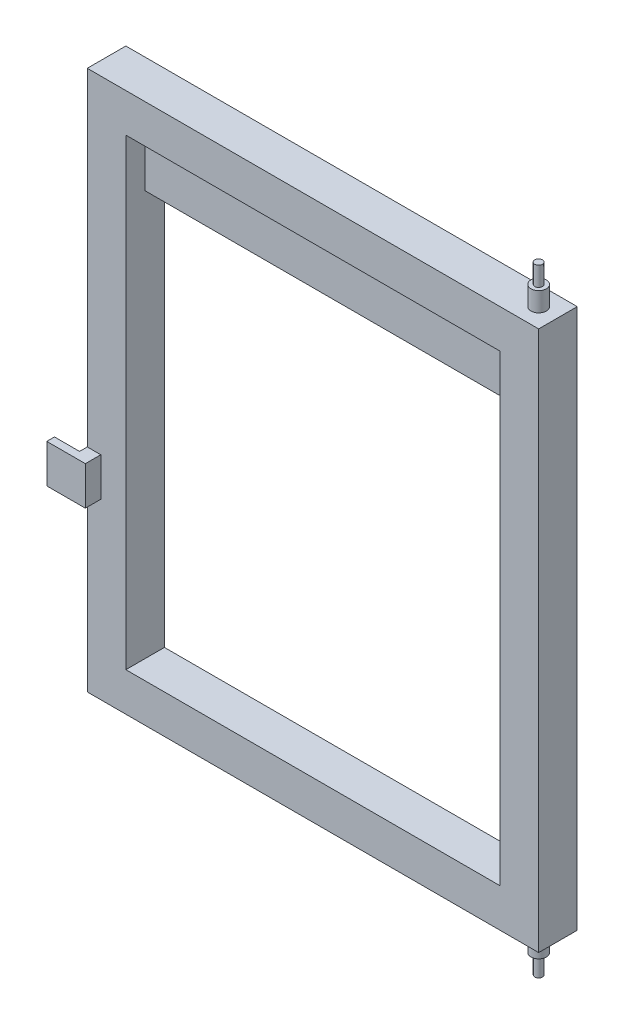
from build123d import *

# Parameters (mm, degrees)
ESQUISSE1_W          = 585
ESQUISSE1_H          = 700
ESQUISSE1_W_2        = 485
ESQUISSE1_H_2        = 600
BASE_EXTRUSION_DEPTH = 25
ESQUISSE3_R          = 5
BOSS_EXTRU_2_DEPTH   = 400
ESQUISSE2_W          = 485
ESQUISSE2_H          = 75
BOSS_EXTRU_1_DEPTH   = 25
BOSS_EXTRU_3_DEPTH   = 25
ESQUISSE5_R          = 10
BOSS_EXTRU_4_DEPTH   = 375


with BuildPart() as part:
    # Esquisse1 → Base-Extrusion (new, symmetric)
    with BuildSketch(Plane.XY):
        Rectangle(ESQUISSE1_W, ESQUISSE1_H)
        Rectangle(ESQUISSE1_W_2, ESQUISSE1_H_2, mode=Mode.SUBTRACT)
    extrude(amount=BASE_EXTRUSION_DEPTH, both=True)

    # Esquisse3 → Boss.-Extru.2 (add, symmetric)
    with BuildSketch(Plane(origin=(0, 0, 0), x_dir=(1, 0, 0), z_dir=(0, 1, 0))):
        with Locations((267.5, 0)):
            Circle(ESQUISSE3_R)
    extrude(amount=BOSS_EXTRU_2_DEPTH, both=True)

    # Esquisse2 → Boss.-Extru.1 (add)
    with BuildSketch(Plane.XY):
        with Locations((0, 262.5)):
            Rectangle(ESQUISSE2_W, ESQUISSE2_H)
    extrude(amount=-BOSS_EXTRU_1_DEPTH)

    # Esquisse4 → Boss.-Extru.3 (add, symmetric)
    with BuildSketch(Plane.XZ.offset(100)):
        Polygon((-292.5, 25), (-275, 25), (-275, 45), (-325, 45), (-325, 35), (-292.5, 35), align=None)
    extrude(amount=BOSS_EXTRU_3_DEPTH, both=True)

    # Esquisse5 → Boss.-Extru.4 (add, symmetric)
    with BuildSketch(Plane(origin=(0, 0, 0), x_dir=(1, 0, 0), z_dir=(0, 1, 0))):
        with Locations(Location((267.5, 0, 0), (0, 0, 180))):
            Circle(ESQUISSE5_R)
    extrude(amount=BOSS_EXTRU_4_DEPTH, both=True)


solid = part.part
